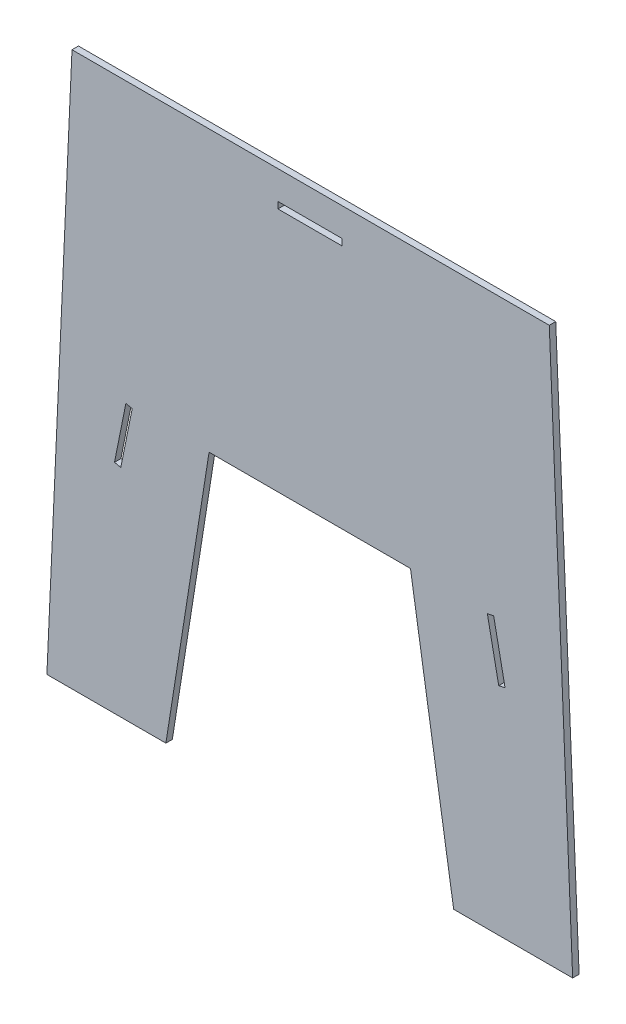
from build123d import *

# Parameters (mm, degrees)
SKETCH1_W           = 15.157160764
SKETCH1_H           = 1.524
BOSS_EXTRUDE1_DEPTH = 1.524


with BuildPart() as part:
    # Sketch1 → Boss-Extrude1 (new body)
    with BuildSketch(Plane.XY):
        Polygon((-62.142082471, -11.74578038), (-56.212958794, 118.946073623), (56.466549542, 118.946073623), (61.985897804, -11.74578038), (33.892242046, -11.74578038), (23.695886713, 52.838068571), (-23.85207138, 52.838068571), (-34.048426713, -11.74578038), align=None)
        Polygon((46.026913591, 39.605536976), (44.53278735, 39.305265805), (41.843303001, 52.687932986), (43.337429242, 52.988204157), align=None, mode=Mode.SUBTRACT)
        Polygon((-43.493613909, 52.988204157), (-46.183098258, 39.605536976), (-44.688972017, 39.305265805), (-41.999487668, 52.687932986), align=None, mode=Mode.SUBTRACT)
        with Locations((-0.018412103, 111.468807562)):
            Rectangle(SKETCH1_W, SKETCH1_H, mode=Mode.SUBTRACT)
    extrude(amount=BOSS_EXTRUDE1_DEPTH)


solid = part.part
